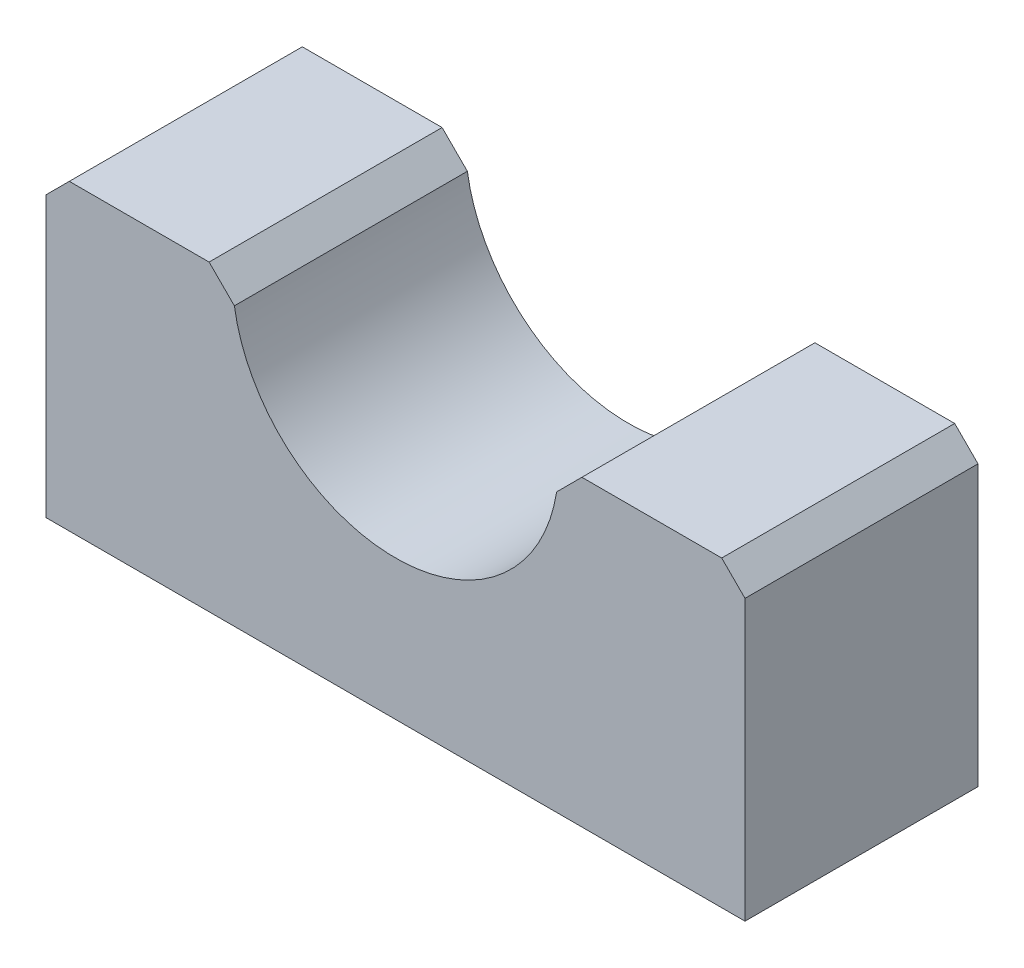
ISO-10303-21;
HEADER;
FILE_DESCRIPTION(('STEP AP214'),'2;1');
FILE_NAME('part.step','',(''),(''),'','','');
FILE_SCHEMA(('AUTOMOTIVE_DESIGN { 1 0 10303 214 1 1 1 1 }'));
ENDSEC;
DATA;
#1=APPLICATION_CONTEXT('core data for automotive mechanical design processes');
#2=APPLICATION_PROTOCOL_DEFINITION('international standard','automotive_design',2000,#1);
#3=PRODUCT_CONTEXT('',#1,'mechanical');
#4=PRODUCT('Part','Part','',(#3));
#5=PRODUCT_RELATED_PRODUCT_CATEGORY('part','',(#4));
#6=PRODUCT_DEFINITION_FORMATION('','',#4);
#7=PRODUCT_DEFINITION_CONTEXT('part definition',#1,'design');
#8=PRODUCT_DEFINITION('design','',#6,#7);
#9=PRODUCT_DEFINITION_SHAPE('','',#8);
#10=(LENGTH_UNIT() NAMED_UNIT(*) SI_UNIT(.MILLI.,.METRE.));
#11=(NAMED_UNIT(*) PLANE_ANGLE_UNIT() SI_UNIT($,.RADIAN.));
#12=(NAMED_UNIT(*) SI_UNIT($,.STERADIAN.) SOLID_ANGLE_UNIT());
#13=UNCERTAINTY_MEASURE_WITH_UNIT(LENGTH_MEASURE(1.E-05),#10,'distance_accuracy_value','');
#14=(GEOMETRIC_REPRESENTATION_CONTEXT(3) GLOBAL_UNCERTAINTY_ASSIGNED_CONTEXT((#13)) GLOBAL_UNIT_ASSIGNED_CONTEXT((#10,
#11,#12)) REPRESENTATION_CONTEXT('',''));
#15=CARTESIAN_POINT('',(0.,0.,0.));
#16=DIRECTION('',(0.,0.,1.));
#17=DIRECTION('',(1.,0.,0.));
#18=AXIS2_PLACEMENT_3D('',#15,#16,#17);
#19=CARTESIAN_POINT('',(75.,-65.,50.));
#20=DIRECTION('',(-1.,0.,0.));
#21=DIRECTION('',(0.,0.,1.));
#22=AXIS2_PLACEMENT_3D('',#19,#20,#21);
#23=PLANE('',#22);
#24=DIRECTION('',(0.,1.,0.));
#25=VECTOR('',#24,1.);
#26=CARTESIAN_POINT('',(75.,-65.,0.));
#27=LINE('',#26,#25);
#28=CARTESIAN_POINT('',(75.,-65.,0.));
#29=VERTEX_POINT('',#28);
#30=CARTESIAN_POINT('',(75.,-4.99999999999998,0.));
#31=VERTEX_POINT('',#30);
#32=EDGE_CURVE('E136',#29,#31,#27,.T.);
#33=ORIENTED_EDGE('',*,*,#32,.T.);
#34=DIRECTION('',(0.,0.,1.));
#35=VECTOR('',#34,1.);
#36=CARTESIAN_POINT('',(75.,-4.99999999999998,50.));
#37=LINE('',#36,#35);
#38=CARTESIAN_POINT('',(75.,-4.99999999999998,50.));
#39=VERTEX_POINT('',#38);
#40=EDGE_CURVE('E163',#31,#39,#37,.T.);
#41=ORIENTED_EDGE('',*,*,#40,.T.);
#42=DIRECTION('',(0.,1.,0.));
#43=VECTOR('',#42,1.);
#44=CARTESIAN_POINT('',(75.,-65.,50.));
#45=LINE('',#44,#43);
#46=CARTESIAN_POINT('',(75.,-65.,50.));
#47=VERTEX_POINT('',#46);
#48=EDGE_CURVE('E149',#47,#39,#45,.T.);
#49=ORIENTED_EDGE('',*,*,#48,.F.);
#50=DIRECTION('',(0.,0.,-1.));
#51=VECTOR('',#50,1.);
#52=CARTESIAN_POINT('',(75.,-65.,50.));
#53=LINE('',#52,#51);
#54=EDGE_CURVE('E127',#47,#29,#53,.T.);
#55=ORIENTED_EDGE('',*,*,#54,.T.);
#56=EDGE_LOOP('',(#33,#41,#49,#55));
#57=FACE_BOUND('',#56,.T.);
#58=ADVANCED_FACE('F32',(#57),#23,.F.);
#59=CARTESIAN_POINT('',(75.,0.,50.));
#60=DIRECTION('',(0.,-1.,0.));
#61=DIRECTION('',(0.,0.,-1.));
#62=AXIS2_PLACEMENT_3D('',#59,#60,#61);
#63=PLANE('',#62);
#64=DIRECTION('',(-1.,0.,0.));
#65=VECTOR('',#64,1.);
#66=CARTESIAN_POINT('',(75.,0.,50.));
#67=LINE('',#66,#65);
#68=CARTESIAN_POINT('',(70.0000000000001,0.,50.));
#69=VERTEX_POINT('',#68);
#70=CARTESIAN_POINT('',(40.,0.,50.));
#71=VERTEX_POINT('',#70);
#72=EDGE_CURVE('E222',#69,#71,#67,.T.);
#73=ORIENTED_EDGE('',*,*,#72,.F.);
#74=DIRECTION('',(0.,0.,-1.));
#75=VECTOR('',#74,1.);
#76=CARTESIAN_POINT('',(70.0000000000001,0.,50.));
#77=LINE('',#76,#75);
#78=CARTESIAN_POINT('',(70.0000000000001,0.,0.));
#79=VERTEX_POINT('',#78);
#80=EDGE_CURVE('E152',#69,#79,#77,.T.);
#81=ORIENTED_EDGE('',*,*,#80,.T.);
#82=DIRECTION('',(-1.,0.,0.));
#83=VECTOR('',#82,1.);
#84=CARTESIAN_POINT('',(75.,0.,0.));
#85=LINE('',#84,#83);
#86=CARTESIAN_POINT('',(40.,0.,0.));
#87=VERTEX_POINT('',#86);
#88=EDGE_CURVE('E139',#79,#87,#85,.T.);
#89=ORIENTED_EDGE('',*,*,#88,.T.);
#90=DIRECTION('',(0.,0.,1.));
#91=VECTOR('',#90,1.);
#92=CARTESIAN_POINT('',(40.,0.,50.));
#93=LINE('',#92,#91);
#94=EDGE_CURVE('E126',#87,#71,#93,.T.);
#95=ORIENTED_EDGE('',*,*,#94,.T.);
#96=EDGE_LOOP('',(#73,#81,#89,#95));
#97=FACE_BOUND('',#96,.T.);
#98=ADVANCED_FACE('F195',(#97),#63,.F.);
#99=CARTESIAN_POINT('',(0.,0.,50.));
#100=DIRECTION('',(0.,0.,-1.));
#101=DIRECTION('',(-1.,0.,0.));
#102=AXIS2_PLACEMENT_3D('',#99,#100,#101);
#103=CYLINDRICAL_SURFACE('',#102,35.);
#104=CARTESIAN_POINT('',(0.,0.,50.));
#105=DIRECTION('',(0.,0.,-1.));
#106=DIRECTION('',(1.,0.,0.));
#107=AXIS2_PLACEMENT_3D('',#104,#105,#106);
#108=CIRCLE('',#107,35.);
#109=CARTESIAN_POINT('',(34.5773797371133,-5.42262026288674,50.));
#110=VERTEX_POINT('',#109);
#111=CARTESIAN_POINT('',(-34.5773797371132,-5.42262026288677,50.));
#112=VERTEX_POINT('',#111);
#113=EDGE_CURVE('E220',#110,#112,#108,.T.);
#114=ORIENTED_EDGE('',*,*,#113,.F.);
#115=DIRECTION('',(0.,0.,-1.));
#116=VECTOR('',#115,1.);
#117=CARTESIAN_POINT('',(34.5773797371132,-5.42262026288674,50.));
#118=LINE('',#117,#116);
#119=CARTESIAN_POINT('',(34.5773797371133,-5.42262026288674,0.));
#120=VERTEX_POINT('',#119);
#121=EDGE_CURVE('E174',#110,#120,#118,.T.);
#122=ORIENTED_EDGE('',*,*,#121,.T.);
#123=CARTESIAN_POINT('',(0.,0.,0.));
#124=DIRECTION('',(0.,0.,-1.));
#125=DIRECTION('',(1.,0.,0.));
#126=AXIS2_PLACEMENT_3D('',#123,#124,#125);
#127=CIRCLE('',#126,35.);
#128=CARTESIAN_POINT('',(-34.5773797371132,-5.42262026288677,0.));
#129=VERTEX_POINT('',#128);
#130=EDGE_CURVE('E142',#120,#129,#127,.T.);
#131=ORIENTED_EDGE('',*,*,#130,.T.);
#132=DIRECTION('',(0.,0.,-1.));
#133=VECTOR('',#132,1.);
#134=CARTESIAN_POINT('',(-34.5773797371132,-5.42262026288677,50.));
#135=LINE('',#134,#133);
#136=EDGE_CURVE('E172',#129,#112,#135,.F.);
#137=ORIENTED_EDGE('',*,*,#136,.T.);
#138=EDGE_LOOP('',(#114,#122,#131,#137));
#139=FACE_BOUND('',#138,.T.);
#140=ADVANCED_FACE('F201',(#139),#103,.F.);
#141=CARTESIAN_POINT('',(-35.,0.,50.));
#142=DIRECTION('',(0.,-1.,0.));
#143=DIRECTION('',(1.,0.,0.));
#144=AXIS2_PLACEMENT_3D('',#141,#142,#143);
#145=PLANE('',#144);
#146=DIRECTION('',(-1.,0.,0.));
#147=VECTOR('',#146,1.);
#148=CARTESIAN_POINT('',(-35.,0.,50.));
#149=LINE('',#148,#147);
#150=CARTESIAN_POINT('',(-40.,0.,50.));
#151=VERTEX_POINT('',#150);
#152=CARTESIAN_POINT('',(-69.9999999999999,0.,50.));
#153=VERTEX_POINT('',#152);
#154=EDGE_CURVE('E117',#151,#153,#149,.T.);
#155=ORIENTED_EDGE('',*,*,#154,.F.);
#156=DIRECTION('',(0.,0.,-1.));
#157=VECTOR('',#156,1.);
#158=CARTESIAN_POINT('',(-40.,0.,50.));
#159=LINE('',#158,#157);
#160=CARTESIAN_POINT('',(-40.,0.,0.));
#161=VERTEX_POINT('',#160);
#162=EDGE_CURVE('E40',#151,#161,#159,.T.);
#163=ORIENTED_EDGE('',*,*,#162,.T.);
#164=DIRECTION('',(-1.,0.,0.));
#165=VECTOR('',#164,1.);
#166=CARTESIAN_POINT('',(-35.,0.,0.));
#167=LINE('',#166,#165);
#168=CARTESIAN_POINT('',(-69.9999999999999,0.,0.));
#169=VERTEX_POINT('',#168);
#170=EDGE_CURVE('E145',#161,#169,#167,.T.);
#171=ORIENTED_EDGE('',*,*,#170,.T.);
#172=DIRECTION('',(0.,0.,1.));
#173=VECTOR('',#172,1.);
#174=CARTESIAN_POINT('',(-69.9999999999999,0.,50.));
#175=LINE('',#174,#173);
#176=EDGE_CURVE('E55',#169,#153,#175,.T.);
#177=ORIENTED_EDGE('',*,*,#176,.T.);
#178=EDGE_LOOP('',(#155,#163,#171,#177));
#179=FACE_BOUND('',#178,.T.);
#180=ADVANCED_FACE('F180',(#179),#145,.F.);
#181=CARTESIAN_POINT('',(-75.,0.,50.));
#182=DIRECTION('',(1.,0.,0.));
#183=DIRECTION('',(0.,1.,0.));
#184=AXIS2_PLACEMENT_3D('',#181,#182,#183);
#185=PLANE('',#184);
#186=DIRECTION('',(0.,-1.,0.));
#187=VECTOR('',#186,1.);
#188=CARTESIAN_POINT('',(-75.,0.,50.));
#189=LINE('',#188,#187);
#190=CARTESIAN_POINT('',(-75.,-5.00000000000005,50.));
#191=VERTEX_POINT('',#190);
#192=CARTESIAN_POINT('',(-75.,-65.,50.));
#193=VERTEX_POINT('',#192);
#194=EDGE_CURVE('E108',#191,#193,#189,.T.);
#195=ORIENTED_EDGE('',*,*,#194,.F.);
#196=DIRECTION('',(0.,0.,-1.));
#197=VECTOR('',#196,1.);
#198=CARTESIAN_POINT('',(-75.,-5.00000000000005,50.));
#199=LINE('',#198,#197);
#200=CARTESIAN_POINT('',(-75.,-5.00000000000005,0.));
#201=VERTEX_POINT('',#200);
#202=EDGE_CURVE('E11',#191,#201,#199,.T.);
#203=ORIENTED_EDGE('',*,*,#202,.T.);
#204=DIRECTION('',(0.,-1.,0.));
#205=VECTOR('',#204,1.);
#206=CARTESIAN_POINT('',(-75.,0.,0.));
#207=LINE('',#206,#205);
#208=CARTESIAN_POINT('',(-75.,-65.,0.));
#209=VERTEX_POINT('',#208);
#210=EDGE_CURVE('E123',#201,#209,#207,.T.);
#211=ORIENTED_EDGE('',*,*,#210,.T.);
#212=DIRECTION('',(0.,0.,-1.));
#213=VECTOR('',#212,1.);
#214=CARTESIAN_POINT('',(-75.,-65.,50.));
#215=LINE('',#214,#213);
#216=EDGE_CURVE('E120',#193,#209,#215,.T.);
#217=ORIENTED_EDGE('',*,*,#216,.F.);
#218=EDGE_LOOP('',(#195,#203,#211,#217));
#219=FACE_BOUND('',#218,.T.);
#220=ADVANCED_FACE('F121',(#219),#185,.F.);
#221=CARTESIAN_POINT('',(-75.,-65.,50.));
#222=DIRECTION('',(0.,1.,0.));
#223=DIRECTION('',(-1.,0.,0.));
#224=AXIS2_PLACEMENT_3D('',#221,#222,#223);
#225=PLANE('',#224);
#226=DIRECTION('',(1.,0.,0.));
#227=VECTOR('',#226,1.);
#228=CARTESIAN_POINT('',(-75.,-65.,0.));
#229=LINE('',#228,#227);
#230=EDGE_CURVE('E148',#209,#29,#229,.T.);
#231=ORIENTED_EDGE('',*,*,#230,.T.);
#232=ORIENTED_EDGE('',*,*,#54,.F.);
#233=DIRECTION('',(1.,0.,0.));
#234=VECTOR('',#233,1.);
#235=CARTESIAN_POINT('',(-75.,-65.,50.));
#236=LINE('',#235,#234);
#237=EDGE_CURVE('E113',#193,#47,#236,.T.);
#238=ORIENTED_EDGE('',*,*,#237,.F.);
#239=ORIENTED_EDGE('',*,*,#216,.T.);
#240=EDGE_LOOP('',(#231,#232,#238,#239));
#241=FACE_BOUND('',#240,.T.);
#242=ADVANCED_FACE('F129',(#241),#225,.F.);
#243=CARTESIAN_POINT('',(0.,0.,50.));
#244=DIRECTION('',(0.,0.,1.));
#245=DIRECTION('',(1.,0.,0.));
#246=AXIS2_PLACEMENT_3D('',#243,#244,#245);
#247=PLANE('',#246);
#248=ORIENTED_EDGE('',*,*,#48,.T.);
#249=DIRECTION('',(0.707106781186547,-0.707106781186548,0.));
#250=VECTOR('',#249,1.);
#251=CARTESIAN_POINT('',(35.0000000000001,35.,50.));
#252=LINE('',#251,#250);
#253=EDGE_CURVE('E170',#39,#69,#252,.F.);
#254=ORIENTED_EDGE('',*,*,#253,.T.);
#255=ORIENTED_EDGE('',*,*,#72,.T.);
#256=DIRECTION('',(0.707106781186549,0.707106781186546,0.));
#257=VECTOR('',#256,1.);
#258=CARTESIAN_POINT('',(19.9999999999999,-20.,50.));
#259=LINE('',#258,#257);
#260=EDGE_CURVE('E168',#71,#110,#259,.F.);
#261=ORIENTED_EDGE('',*,*,#260,.T.);
#262=ORIENTED_EDGE('',*,*,#113,.T.);
#263=DIRECTION('',(0.707106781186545,-0.70710678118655,0.));
#264=VECTOR('',#263,1.);
#265=CARTESIAN_POINT('',(-20.0000000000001,-20.,50.));
#266=LINE('',#265,#264);
#267=EDGE_CURVE('E166',#112,#151,#266,.F.);
#268=ORIENTED_EDGE('',*,*,#267,.T.);
#269=ORIENTED_EDGE('',*,*,#154,.T.);
#270=DIRECTION('',(0.707106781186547,0.707106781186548,0.));
#271=VECTOR('',#270,1.);
#272=CARTESIAN_POINT('',(-35.,35.,50.));
#273=LINE('',#272,#271);
#274=EDGE_CURVE('E47',#153,#191,#273,.F.);
#275=ORIENTED_EDGE('',*,*,#274,.T.);
#276=ORIENTED_EDGE('',*,*,#194,.T.);
#277=ORIENTED_EDGE('',*,*,#237,.T.);
#278=EDGE_LOOP('',(#248,#254,#255,#261,#262,#268,#269,#275,#276,#277));
#279=FACE_BOUND('',#278,.T.);
#280=ADVANCED_FACE('F111',(#279),#247,.T.);
#281=CARTESIAN_POINT('',(0.,0.,0.));
#282=DIRECTION('',(0.,0.,1.));
#283=DIRECTION('',(1.,0.,0.));
#284=AXIS2_PLACEMENT_3D('',#281,#282,#283);
#285=PLANE('',#284);
#286=ORIENTED_EDGE('',*,*,#88,.F.);
#287=DIRECTION('',(-0.707106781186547,0.707106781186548,0.));
#288=VECTOR('',#287,1.);
#289=CARTESIAN_POINT('',(70.0000000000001,0.,0.));
#290=LINE('',#289,#288);
#291=EDGE_CURVE('E161',#79,#31,#290,.F.);
#292=ORIENTED_EDGE('',*,*,#291,.T.);
#293=ORIENTED_EDGE('',*,*,#32,.F.);
#294=ORIENTED_EDGE('',*,*,#230,.F.);
#295=ORIENTED_EDGE('',*,*,#210,.F.);
#296=DIRECTION('',(-0.707106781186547,-0.707106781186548,0.));
#297=VECTOR('',#296,1.);
#298=CARTESIAN_POINT('',(-75.,-5.00000000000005,0.));
#299=LINE('',#298,#297);
#300=EDGE_CURVE('E155',#201,#169,#299,.F.);
#301=ORIENTED_EDGE('',*,*,#300,.T.);
#302=ORIENTED_EDGE('',*,*,#170,.F.);
#303=DIRECTION('',(-0.707106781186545,0.70710678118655,0.));
#304=VECTOR('',#303,1.);
#305=CARTESIAN_POINT('',(-40.,0.,0.));
#306=LINE('',#305,#304);
#307=EDGE_CURVE('E157',#161,#129,#306,.F.);
#308=ORIENTED_EDGE('',*,*,#307,.T.);
#309=ORIENTED_EDGE('',*,*,#130,.F.);
#310=DIRECTION('',(-0.707106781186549,-0.707106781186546,0.));
#311=VECTOR('',#310,1.);
#312=CARTESIAN_POINT('',(34.5773797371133,-5.42262026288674,0.));
#313=LINE('',#312,#311);
#314=EDGE_CURVE('E159',#120,#87,#313,.F.);
#315=ORIENTED_EDGE('',*,*,#314,.T.);
#316=EDGE_LOOP('',(#286,#292,#293,#294,#295,#301,#302,#308,#309,#315));
#317=FACE_BOUND('',#316,.T.);
#318=ADVANCED_FACE('F185',(#317),#285,.F.);
#319=CARTESIAN_POINT('',(70.0000000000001,0.,50.));
#320=DIRECTION('',(-0.707106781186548,-0.707106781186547,0.));
#321=DIRECTION('',(0.,0.,-1.));
#322=AXIS2_PLACEMENT_3D('',#319,#320,#321);
#323=PLANE('',#322);
#324=ORIENTED_EDGE('',*,*,#253,.F.);
#325=ORIENTED_EDGE('',*,*,#40,.F.);
#326=ORIENTED_EDGE('',*,*,#291,.F.);
#327=ORIENTED_EDGE('',*,*,#80,.F.);
#328=EDGE_LOOP('',(#324,#325,#326,#327));
#329=FACE_BOUND('',#328,.T.);
#330=ADVANCED_FACE('F206',(#329),#323,.F.);
#331=CARTESIAN_POINT('',(34.5773797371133,-5.42262026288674,50.));
#332=DIRECTION('',(0.707106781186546,-0.707106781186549,0.));
#333=DIRECTION('',(0.,0.,-1.));
#334=AXIS2_PLACEMENT_3D('',#331,#332,#333);
#335=PLANE('',#334);
#336=ORIENTED_EDGE('',*,*,#260,.F.);
#337=ORIENTED_EDGE('',*,*,#94,.F.);
#338=ORIENTED_EDGE('',*,*,#314,.F.);
#339=ORIENTED_EDGE('',*,*,#121,.F.);
#340=EDGE_LOOP('',(#336,#337,#338,#339));
#341=FACE_BOUND('',#340,.T.);
#342=ADVANCED_FACE('F193',(#341),#335,.F.);
#343=CARTESIAN_POINT('',(-40.,0.,50.));
#344=DIRECTION('',(-0.70710678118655,-0.707106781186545,0.));
#345=DIRECTION('',(0.,0.,-1.));
#346=AXIS2_PLACEMENT_3D('',#343,#344,#345);
#347=PLANE('',#346);
#348=ORIENTED_EDGE('',*,*,#267,.F.);
#349=ORIENTED_EDGE('',*,*,#136,.F.);
#350=ORIENTED_EDGE('',*,*,#307,.F.);
#351=ORIENTED_EDGE('',*,*,#162,.F.);
#352=EDGE_LOOP('',(#348,#349,#350,#351));
#353=FACE_BOUND('',#352,.T.);
#354=ADVANCED_FACE('F189',(#353),#347,.F.);
#355=CARTESIAN_POINT('',(-75.,-5.00000000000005,50.));
#356=DIRECTION('',(0.707106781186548,-0.707106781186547,0.));
#357=DIRECTION('',(0.,0.,-1.));
#358=AXIS2_PLACEMENT_3D('',#355,#356,#357);
#359=PLANE('',#358);
#360=ORIENTED_EDGE('',*,*,#274,.F.);
#361=ORIENTED_EDGE('',*,*,#176,.F.);
#362=ORIENTED_EDGE('',*,*,#300,.F.);
#363=ORIENTED_EDGE('',*,*,#202,.F.);
#364=EDGE_LOOP('',(#360,#361,#362,#363));
#365=FACE_BOUND('',#364,.T.);
#366=ADVANCED_FACE('F34',(#365),#359,.F.);
#367=CLOSED_SHELL('',(#58,#98,#140,#180,#220,#242,#280,#318,#330,#342,#354,#366));
#368=MANIFOLD_SOLID_BREP('B2',#367);
#369=ADVANCED_BREP_SHAPE_REPRESENTATION('',(#18,#368),#14);
#370=SHAPE_DEFINITION_REPRESENTATION(#9,#369);
ENDSEC;
END-ISO-10303-21;
